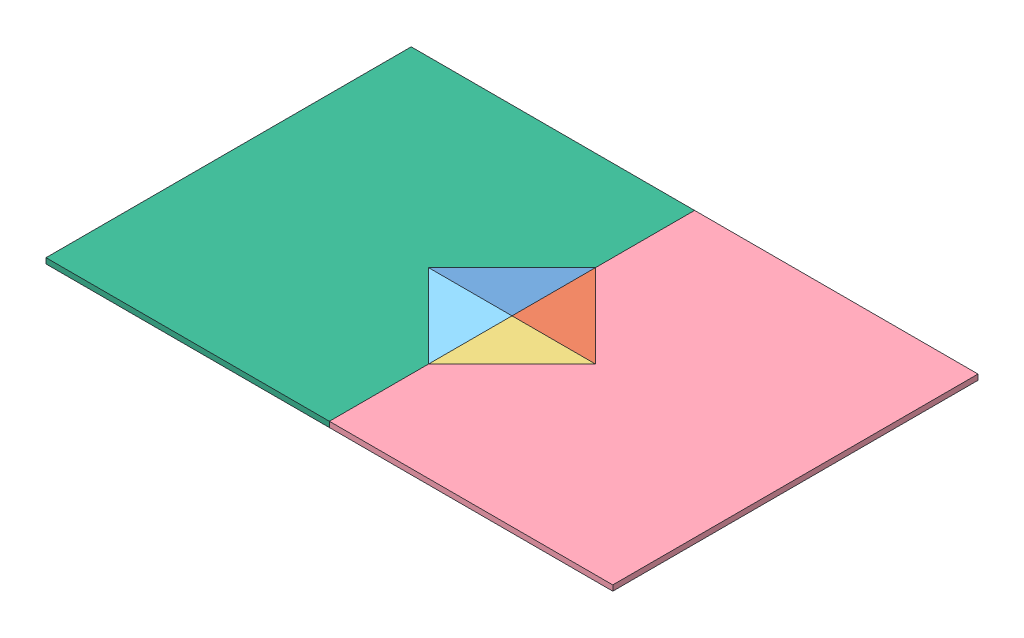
SolidWorks assembly example.sldasm, configuration Default (file format 7000). Lengths in mm.
Overall size (103.61 1 66.76).
6 component instances, 6 part files, 13 mates.
Components (placement in the parent):
- Thicken4-1: Thicken4.sldprt [Default] at origin size (15.24 1 15.24)
- Thicken5-1: Thicken5.sldprt [Default] at origin size (15.24 1 15.24)
- Thicken6-1: Thicken6.sldprt [Default] at origin size (15.24 1 15.24)
- Thicken3-1: Thicken3.sldprt [Default] at origin size (51.8 1 66.76)
- Thicken7-1: Thicken7.sldprt [Default] at origin size (15.24 1 15.24)
- Thicken2-1: Thicken2.sldprt [Default] at origin size (51.8 1 66.76)
Mates (geometry in assembly coordinates):
- Coincident2: coincident aligned: line of Thicken6-1 through (15.2356 10.5 0) axis (-0.707107 0 0.707107); line of Thicken3-1 through (15.2356 10.5 0) axis (-0.707107 0 0.707107)
- Coincident3: coincident: point of Thicken6-1; point of Thicken3-1
- Coincident4: coincident aligned: line of Thicken5-1 through (0 10.5 -15.2356) axis (0.707107 0 0.707107); line of Thicken3-1 through (0 10.5 -15.2356) axis (0.707107 0 0.707107)
- Coincident5: coincident: point of Thicken5-1; point of Thicken3-1
- Coincident6: coincident aligned: line of Thicken4-1 through (-13.2442 18.031 0) axis (0.614681 -0.349525 -0.707107); line of Thicken2-1 through (-13.2442 18.031 0) axis (0.614681 -0.349525 -0.707107)
- Coincident7: coincident: point of Thicken4-1; point of Thicken2-1
- Coincident8: coincident aligned: line of Thicken7-1 through (0 10.5 15.2356) axis (-0.614681 0.349525 -0.707107); line of Thicken2-1 through (0 10.5 15.2356) axis (-0.614681 0.349525 -0.707107)
- Coincident9: coincident: point of Thicken7-1; point of Thicken2-1
- Coincident10: coincident aligned: line of Thicken3-1 through (0 10.5 33.3821) axis (0 0 -1); line of Thicken2-1 through (0 10.5 33.3821) axis (0 0 -1)
- Coincident11: coincident: point of Thicken3-1; point of Thicken2-1
- Coincident14: coincident aligned: line of Thicken4-1 through (1.8693 17.569 -1.8693) axis (-0.122692 -0.463979 -0.877308); line of Thicken5-1 through (1.8693 17.569 -1.8693) axis (-0.122692 -0.463979 -0.877308)
- Coincident15: coincident aligned: line of Thicken6-1 through (0 10.5 15.2356) axis (0.122692 0.463979 -0.877308); line of Thicken7-1 through (0 10.5 15.2356) axis (0.122692 0.463979 -0.877308)
- Coincident16: coincident aligned: plane of Thicken3-1 through (0 10.5 0) normal (0 1 0); plane of Thicken2-1 through (0 10.5 0) normal (0 1 0)
